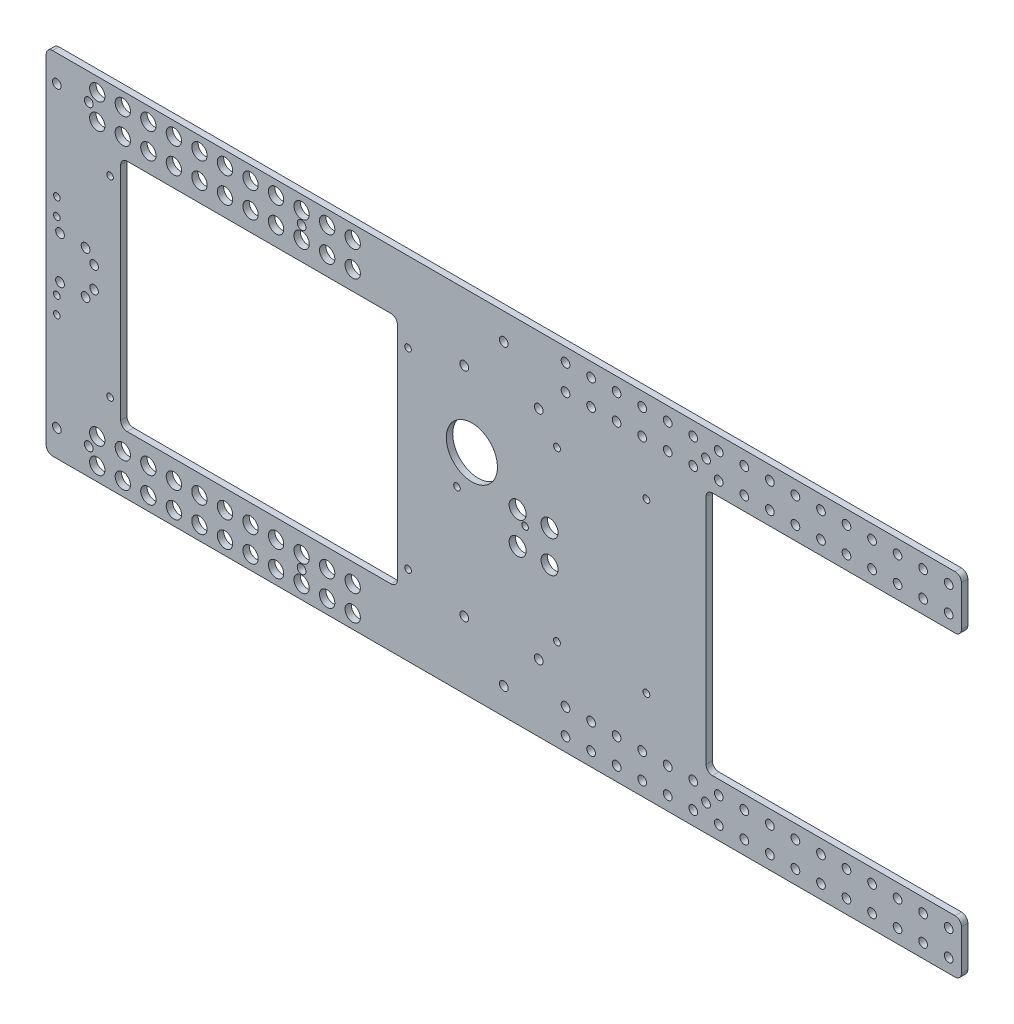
from build123d import *

# Parameters (mm, degrees)
SKETCH_1_W           = 430
SKETCH_1_H           = 165
SKETCH_1_R           = 2.05
EXTRUDE_1_DEPTH      = 3
SKETCH_2_R           = 4
SKETCH_2_R_2         = 12
CUT_EXTRUDE_1_DEPTH  = 25.001
SKETCH_3_R           = 2.05
SKETCH_3_R_2         = 1.55
SKETCH_3_W           = 130
SKETCH_3_H           = 110
CUT_EXTRUDE_2_DEPTH  = 10
SKETCH_4_R           = 2
CUT_EXTRUDE_3_DEPTH  = 5
SKETCH_5_W           = 240
SKETCH_5_H           = 115
CUT_EXTRUDE_4_DEPTH  = 10
SKETCH_7_R           = 2.05
CUT_EXTRUDE_5_DEPTH  = 66
SKETCH_8_R           = 1.6
CUT_EXTRUDE_6_DEPTH  = 10
SKETCH_9_R           = 1.55
CUT_EXTRUDE_7_DEPTH  = 10
SKETCH_10_R          = 1.55
CUT_EXTRUDE_8_DEPTH  = 10
SKETCH_11_R          = 2.05
CUT_EXTRUDE_9_DEPTH  = 3
SKETCH_12_R          = 3.6
CUT_EXTRUDE_10_DEPTH = 10
FILLET_1_R           = 3


with BuildPart() as part:
    # Sketch 1 → Extrude 1 (new body)
    with BuildSketch(Plane.XY):
        Rectangle(SKETCH_1_W, SKETCH_1_H)
        with Locations((-210, 70)):
            Circle(SKETCH_1_R, mode=Mode.SUBTRACT)
        with Locations((209, 76)):
            Circle(SKETCH_1_R, mode=Mode.SUBTRACT)
        with Locations(Location((209, 64, 0), (0, 0, 180))):
            Circle(SKETCH_1_R, mode=Mode.SUBTRACT)
        with Locations((-210, -70)):
            Circle(SKETCH_1_R, mode=Mode.SUBTRACT)
        with Locations((-195, 70)):
            Circle(SKETCH_1_R, mode=Mode.SUBTRACT)
        with Locations((209, -64)):
            Circle(SKETCH_1_R, mode=Mode.SUBTRACT)
        with Locations(Location((-195, -70, 0), (0, 0, 180))):
            Circle(SKETCH_1_R, mode=Mode.SUBTRACT)
        with Locations(Location((209, -76, 0), (0, 0, 180))):
            Circle(SKETCH_1_R, mode=Mode.SUBTRACT)
        with Locations((197, 76)):
            Circle(SKETCH_1_R, mode=Mode.SUBTRACT)
        with Locations(Location((197, 64, 0), (0, 0, 180))):
            Circle(SKETCH_1_R, mode=Mode.SUBTRACT)
        with Locations((197, -64)):
            Circle(SKETCH_1_R, mode=Mode.SUBTRACT)
        with Locations(Location((197, -76, 0), (0, 0, 180))):
            Circle(SKETCH_1_R, mode=Mode.SUBTRACT)
        with Locations((185, 76)):
            Circle(SKETCH_1_R, mode=Mode.SUBTRACT)
        with Locations(Location((185, 64, 0), (0, 0, 180))):
            Circle(SKETCH_1_R, mode=Mode.SUBTRACT)
        with Locations((185, -64)):
            Circle(SKETCH_1_R, mode=Mode.SUBTRACT)
        with Locations(Location((185, -76, 0), (0, 0, 180))):
            Circle(SKETCH_1_R, mode=Mode.SUBTRACT)
        with Locations((173, 76)):
            Circle(SKETCH_1_R, mode=Mode.SUBTRACT)
        with Locations(Location((173, 64, 0), (0, 0, 180))):
            Circle(SKETCH_1_R, mode=Mode.SUBTRACT)
        with Locations((173, -64)):
            Circle(SKETCH_1_R, mode=Mode.SUBTRACT)
        with Locations(Location((173, -76, 0), (0, 0, 180))):
            Circle(SKETCH_1_R, mode=Mode.SUBTRACT)
        with Locations((161, 76)):
            Circle(SKETCH_1_R, mode=Mode.SUBTRACT)
        with Locations(Location((161, 64, 0), (0, 0, 180))):
            Circle(SKETCH_1_R, mode=Mode.SUBTRACT)
        with Locations((161, -64)):
            Circle(SKETCH_1_R, mode=Mode.SUBTRACT)
        with Locations(Location((161, -76, 0), (0, 0, 180))):
            Circle(SKETCH_1_R, mode=Mode.SUBTRACT)
        with Locations((149, 76)):
            Circle(SKETCH_1_R, mode=Mode.SUBTRACT)
        with Locations(Location((149, 64, 0), (0, 0, 180))):
            Circle(SKETCH_1_R, mode=Mode.SUBTRACT)
        with Locations((149, -64)):
            Circle(SKETCH_1_R, mode=Mode.SUBTRACT)
        with Locations(Location((149, -76, 0), (0, 0, 180))):
            Circle(SKETCH_1_R, mode=Mode.SUBTRACT)
        with Locations((137, 76)):
            Circle(SKETCH_1_R, mode=Mode.SUBTRACT)
        with Locations(Location((137, 64, 0), (0, 0, 180))):
            Circle(SKETCH_1_R, mode=Mode.SUBTRACT)
        with Locations((137, -64)):
            Circle(SKETCH_1_R, mode=Mode.SUBTRACT)
        with Locations(Location((137, -76, 0), (0, 0, 180))):
            Circle(SKETCH_1_R, mode=Mode.SUBTRACT)
        with Locations((125, 76)):
            Circle(SKETCH_1_R, mode=Mode.SUBTRACT)
        with Locations(Location((125, 64, 0), (0, 0, 180))):
            Circle(SKETCH_1_R, mode=Mode.SUBTRACT)
        with Locations((125, -64)):
            Circle(SKETCH_1_R, mode=Mode.SUBTRACT)
        with Locations(Location((125, -76, 0), (0, 0, 180))):
            Circle(SKETCH_1_R, mode=Mode.SUBTRACT)
        with Locations((113, 76)):
            Circle(SKETCH_1_R, mode=Mode.SUBTRACT)
        with Locations(Location((113, 64, 0), (0, 0, 180))):
            Circle(SKETCH_1_R, mode=Mode.SUBTRACT)
        with Locations((113, -64)):
            Circle(SKETCH_1_R, mode=Mode.SUBTRACT)
        with Locations(Location((113, -76, 0), (0, 0, 180))):
            Circle(SKETCH_1_R, mode=Mode.SUBTRACT)
        with Locations((101, 76)):
            Circle(SKETCH_1_R, mode=Mode.SUBTRACT)
        with Locations(Location((101, 64, 0), (0, 0, 180))):
            Circle(SKETCH_1_R, mode=Mode.SUBTRACT)
        with Locations((101, -64)):
            Circle(SKETCH_1_R, mode=Mode.SUBTRACT)
        with Locations(Location((101, -76, 0), (0, 0, 180))):
            Circle(SKETCH_1_R, mode=Mode.SUBTRACT)
        with Locations((89, 76)):
            Circle(SKETCH_1_R, mode=Mode.SUBTRACT)
        with Locations(Location((89, 64, 0), (0, 0, 180))):
            Circle(SKETCH_1_R, mode=Mode.SUBTRACT)
        with Locations((89, -64)):
            Circle(SKETCH_1_R, mode=Mode.SUBTRACT)
        with Locations(Location((89, -76, 0), (0, 0, 180))):
            Circle(SKETCH_1_R, mode=Mode.SUBTRACT)
        with Locations((77, 76)):
            Circle(SKETCH_1_R, mode=Mode.SUBTRACT)
        with Locations(Location((77, 64, 0), (0, 0, 180))):
            Circle(SKETCH_1_R, mode=Mode.SUBTRACT)
        with Locations((77, -64)):
            Circle(SKETCH_1_R, mode=Mode.SUBTRACT)
        with Locations(Location((77, -76, 0), (0, 0, 180))):
            Circle(SKETCH_1_R, mode=Mode.SUBTRACT)
        with Locations((65, 76)):
            Circle(SKETCH_1_R, mode=Mode.SUBTRACT)
        with Locations(Location((65, 64, 0), (0, 0, 180))):
            Circle(SKETCH_1_R, mode=Mode.SUBTRACT)
        with Locations((65, -64)):
            Circle(SKETCH_1_R, mode=Mode.SUBTRACT)
        with Locations(Location((65, -76, 0), (0, 0, 180))):
            Circle(SKETCH_1_R, mode=Mode.SUBTRACT)
        with Locations((53, 76)):
            Circle(SKETCH_1_R, mode=Mode.SUBTRACT)
        with Locations(Location((53, 64, 0), (0, 0, 180))):
            Circle(SKETCH_1_R, mode=Mode.SUBTRACT)
        with Locations((53, -64)):
            Circle(SKETCH_1_R, mode=Mode.SUBTRACT)
        with Locations(Location((53, -76, 0), (0, 0, 180))):
            Circle(SKETCH_1_R, mode=Mode.SUBTRACT)
        with Locations((41, 76)):
            Circle(SKETCH_1_R, mode=Mode.SUBTRACT)
        with Locations(Location((41, 64, 0), (0, 0, 180))):
            Circle(SKETCH_1_R, mode=Mode.SUBTRACT)
        with Locations((41, -64)):
            Circle(SKETCH_1_R, mode=Mode.SUBTRACT)
        with Locations(Location((41, -76, 0), (0, 0, 180))):
            Circle(SKETCH_1_R, mode=Mode.SUBTRACT)
        with Locations((29, 76)):
            Circle(SKETCH_1_R, mode=Mode.SUBTRACT)
        with Locations(Location((29, 64, 0), (0, 0, 180))):
            Circle(SKETCH_1_R, mode=Mode.SUBTRACT)
        with Locations((29, -64)):
            Circle(SKETCH_1_R, mode=Mode.SUBTRACT)
        with Locations(Location((29, -76, 0), (0, 0, 180))):
            Circle(SKETCH_1_R, mode=Mode.SUBTRACT)
        with Locations((-71, 76)):
            Circle(SKETCH_1_R, mode=Mode.SUBTRACT)
        with Locations(Location((-71, 64, 0), (0, 0, 180))):
            Circle(SKETCH_1_R, mode=Mode.SUBTRACT)
        with Locations((-71, -64)):
            Circle(SKETCH_1_R, mode=Mode.SUBTRACT)
        with Locations(Location((-71, -76, 0), (0, 0, 180))):
            Circle(SKETCH_1_R, mode=Mode.SUBTRACT)
        with Locations((-83, 76)):
            Circle(SKETCH_1_R, mode=Mode.SUBTRACT)
        with Locations(Location((-83, 64, 0), (0, 0, 180))):
            Circle(SKETCH_1_R, mode=Mode.SUBTRACT)
        with Locations((-83, -64)):
            Circle(SKETCH_1_R, mode=Mode.SUBTRACT)
        with Locations(Location((-83, -76, 0), (0, 0, 180))):
            Circle(SKETCH_1_R, mode=Mode.SUBTRACT)
        with Locations((-95, 76)):
            Circle(SKETCH_1_R, mode=Mode.SUBTRACT)
        with Locations(Location((-95, 64, 0), (0, 0, 180))):
            Circle(SKETCH_1_R, mode=Mode.SUBTRACT)
        with Locations((-95, -64)):
            Circle(SKETCH_1_R, mode=Mode.SUBTRACT)
        with Locations(Location((-95, -76, 0), (0, 0, 180))):
            Circle(SKETCH_1_R, mode=Mode.SUBTRACT)
        with Locations((-107, 76)):
            Circle(SKETCH_1_R, mode=Mode.SUBTRACT)
        with Locations(Location((-107, 64, 0), (0, 0, 180))):
            Circle(SKETCH_1_R, mode=Mode.SUBTRACT)
        with Locations((-107, -64)):
            Circle(SKETCH_1_R, mode=Mode.SUBTRACT)
        with Locations(Location((-107, -76, 0), (0, 0, 180))):
            Circle(SKETCH_1_R, mode=Mode.SUBTRACT)
        with Locations((-119, 76)):
            Circle(SKETCH_1_R, mode=Mode.SUBTRACT)
        with Locations(Location((-119, 64, 0), (0, 0, 180))):
            Circle(SKETCH_1_R, mode=Mode.SUBTRACT)
        with Locations((-119, -64)):
            Circle(SKETCH_1_R, mode=Mode.SUBTRACT)
        with Locations(Location((-119, -76, 0), (0, 0, 180))):
            Circle(SKETCH_1_R, mode=Mode.SUBTRACT)
        with Locations((-131, 76)):
            Circle(SKETCH_1_R, mode=Mode.SUBTRACT)
        with Locations(Location((-131, 64, 0), (0, 0, 180))):
            Circle(SKETCH_1_R, mode=Mode.SUBTRACT)
        with Locations((-131, -64)):
            Circle(SKETCH_1_R, mode=Mode.SUBTRACT)
        with Locations(Location((-131, -76, 0), (0, 0, 180))):
            Circle(SKETCH_1_R, mode=Mode.SUBTRACT)
        with Locations((-143, 76)):
            Circle(SKETCH_1_R, mode=Mode.SUBTRACT)
        with Locations(Location((-143, 64, 0), (0, 0, 180))):
            Circle(SKETCH_1_R, mode=Mode.SUBTRACT)
        with Locations((-143, -64)):
            Circle(SKETCH_1_R, mode=Mode.SUBTRACT)
        with Locations(Location((-143, -76, 0), (0, 0, 180))):
            Circle(SKETCH_1_R, mode=Mode.SUBTRACT)
        with Locations((-155, 76)):
            Circle(SKETCH_1_R, mode=Mode.SUBTRACT)
        with Locations(Location((-155, 64, 0), (0, 0, 180))):
            Circle(SKETCH_1_R, mode=Mode.SUBTRACT)
        with Locations((-155, -64)):
            Circle(SKETCH_1_R, mode=Mode.SUBTRACT)
        with Locations(Location((-155, -76, 0), (0, 0, 180))):
            Circle(SKETCH_1_R, mode=Mode.SUBTRACT)
        with Locations((-167, 76)):
            Circle(SKETCH_1_R, mode=Mode.SUBTRACT)
        with Locations(Location((-167, 64, 0), (0, 0, 180))):
            Circle(SKETCH_1_R, mode=Mode.SUBTRACT)
        with Locations((-167, -64)):
            Circle(SKETCH_1_R, mode=Mode.SUBTRACT)
        with Locations(Location((-167, -76, 0), (0, 0, 180))):
            Circle(SKETCH_1_R, mode=Mode.SUBTRACT)
        with Locations((-179, 76)):
            Circle(SKETCH_1_R, mode=Mode.SUBTRACT)
        with Locations(Location((-179, 64, 0), (0, 0, 180))):
            Circle(SKETCH_1_R, mode=Mode.SUBTRACT)
        with Locations((-179, -64)):
            Circle(SKETCH_1_R, mode=Mode.SUBTRACT)
        with Locations(Location((-179, -76, 0), (0, 0, 180))):
            Circle(SKETCH_1_R, mode=Mode.SUBTRACT)
        with Locations((-191, 76)):
            Circle(SKETCH_1_R, mode=Mode.SUBTRACT)
        with Locations(Location((-191, 64, 0), (0, 0, 180))):
            Circle(SKETCH_1_R, mode=Mode.SUBTRACT)
        with Locations((-191, -64)):
            Circle(SKETCH_1_R, mode=Mode.SUBTRACT)
        with Locations(Location((-191, -76, 0), (0, 0, 180))):
            Circle(SKETCH_1_R, mode=Mode.SUBTRACT)
    extrude(amount=EXTRUDE_1_DEPTH)

    # Sketch 2 → Cut-Extrude 1 (cut)
    with BuildSketch(Plane.XY.offset(3)):
        with Locations((6.5, 5)):
            Circle(SKETCH_2_R)
        with Locations((-15, 17.5)):
            Circle(SKETCH_2_R_2)
        with Locations((21.5, 5)):
            Circle(SKETCH_2_R)
        with Locations((21.5, -10)):
            Circle(SKETCH_2_R)
        with Locations((6.5, -10)):
            Circle(SKETCH_2_R)
    extrude(amount=-CUT_EXTRUDE_1_DEPTH, mode=Mode.SUBTRACT)

    # Sketch 3 → Cut-Extrude 2 (cut)
    with BuildSketch(Plane.XY.offset(3)):
        with Locations((-208.5, 10)):
            Circle(SKETCH_3_R)
        with Locations((-196.5, 10)):
            Circle(SKETCH_3_R)
        with Locations((-196.5, -10)):
            Circle(SKETCH_3_R)
        with Locations((-208.5, -10)):
            Circle(SKETCH_3_R)
        with Locations((-22, 0)):
            Circle(SKETCH_3_R_2)
        with Locations((10, 0)):
            Circle(SKETCH_3_R_2)
        with Locations((-115, 0)):
            Rectangle(SKETCH_3_W, SKETCH_3_H)
    extrude(amount=-CUT_EXTRUDE_2_DEPTH, mode=Mode.SUBTRACT)

    # Sketch 4 → Cut-Extrude 3 (cut)
    with BuildSketch(Plane.XY.offset(3)):
        with Locations((-192.5, 5)):
            Circle(SKETCH_4_R)
        with Locations(Location((-192.5, -5, 0), (0, 0, 180))):
            Circle(SKETCH_4_R)
    extrude(amount=-CUT_EXTRUDE_3_DEPTH, mode=Mode.SUBTRACT)

    # Sketch 5 → Cut-Extrude 4 (cut)
    with BuildSketch(Plane.XY.offset(3)):
        with Locations((215, 0)):
            Rectangle(SKETCH_5_W, SKETCH_5_H)
    extrude(amount=-CUT_EXTRUDE_4_DEPTH, mode=Mode.SUBTRACT)

    # Sketch 7 → Cut-Extrude 5 (cut)
    with BuildSketch(Plane.XY.offset(3)):
        with Locations((-95, -70)):
            Circle(SKETCH_7_R)
        with Locations((0, -70)):
            Circle(SKETCH_7_R)
        with Locations((95, -70)):
            Circle(SKETCH_7_R)
        with Locations(Location((95, 70, 0), (0, 0, 180))):
            Circle(SKETCH_7_R)
        with Locations(Location((0, 70, 0), (0, 0, 180))):
            Circle(SKETCH_7_R)
        with Locations(Location((-95, 70, 0), (0, 0, 180))):
            Circle(SKETCH_7_R)
    extrude(amount=-CUT_EXTRUDE_5_DEPTH, mode=Mode.SUBTRACT)

    # Sketch 8 → Cut-Extrude 6 (cut)
    with BuildSketch(Plane.XY.offset(3)):
        with Locations((25, 39.5)):
            Circle(SKETCH_8_R)
        with Locations((67, 39.5)):
            Circle(SKETCH_8_R)
        with Locations((67, -39.5)):
            Circle(SKETCH_8_R)
        with Locations((25, -39.5)):
            Circle(SKETCH_8_R)
    extrude(amount=-CUT_EXTRUDE_6_DEPTH, mode=Mode.SUBTRACT)

    # Sketch 9 → Cut-Extrude 7 (cut)
    with BuildSketch(Plane.XY.offset(3)):
        with Locations((-45, 45)):
            Circle(SKETCH_9_R)
        with Locations((-185, -45)):
            Circle(SKETCH_9_R)
        with Locations(Location((-45, -45, 0), (0, 0, 180))):
            Circle(SKETCH_9_R)
        with Locations(Location((-185, 45, 0), (0, 0, 180))):
            Circle(SKETCH_9_R)
    extrude(amount=-CUT_EXTRUDE_7_DEPTH, mode=Mode.SUBTRACT)

    # Sketch 10 → Cut-Extrude 8 (cut)
    with BuildSketch(Plane(origin=(0, 0, 0), x_dir=(-1, 0, 0), z_dir=(0, 0, -1))):
        with Locations((210, 16)):
            Circle(SKETCH_10_R)
        with Locations((210, 24)):
            Circle(SKETCH_10_R)
        with Locations((210, -16)):
            Circle(SKETCH_10_R)
        with Locations((210, -24)):
            Circle(SKETCH_10_R)
    extrude(amount=-CUT_EXTRUDE_8_DEPTH, mode=Mode.SUBTRACT)

    # Sketch 11 → Cut-Extrude 9 (cut)
    with BuildSketch(Plane.XY.offset(3)):
        with Locations((-18.593678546, 51)):
            Circle(SKETCH_11_R)
        with Locations((16.406321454, 51)):
            Circle(SKETCH_11_R)
        with Locations((16.406321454, -51)):
            Circle(SKETCH_11_R)
        with Locations((-18.593678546, -51)):
            Circle(SKETCH_11_R)
    extrude(amount=-CUT_EXTRUDE_9_DEPTH, mode=Mode.SUBTRACT)

    # Sketch 12 → Cut-Extrude 10 (cut)
    with BuildSketch(Plane.XY.offset(3)):
        with Locations((-191, 76)):
            Circle(SKETCH_12_R)
        with Locations((-191, 64)):
            Circle(SKETCH_12_R)
        with Locations((-191, -64)):
            Circle(SKETCH_12_R)
        with Locations((-191, -76)):
            Circle(SKETCH_12_R)
        with Locations((-179, 76)):
            Circle(SKETCH_12_R)
        with Locations((-179, 64)):
            Circle(SKETCH_12_R)
        with Locations((-179, -64)):
            Circle(SKETCH_12_R)
        with Locations((-179, -76)):
            Circle(SKETCH_12_R)
        with Locations((-167, 76)):
            Circle(SKETCH_12_R)
        with Locations((-167, 64)):
            Circle(SKETCH_12_R)
        with Locations((-167, -64)):
            Circle(SKETCH_12_R)
        with Locations((-167, -76)):
            Circle(SKETCH_12_R)
        with Locations((-155, 76)):
            Circle(SKETCH_12_R)
        with Locations((-155, 64)):
            Circle(SKETCH_12_R)
        with Locations((-155, -64)):
            Circle(SKETCH_12_R)
        with Locations((-155, -76)):
            Circle(SKETCH_12_R)
        with Locations((-143, 76)):
            Circle(SKETCH_12_R)
        with Locations((-143, 64)):
            Circle(SKETCH_12_R)
        with Locations((-143, -64)):
            Circle(SKETCH_12_R)
        with Locations((-143, -76)):
            Circle(SKETCH_12_R)
        with Locations((-131, 76)):
            Circle(SKETCH_12_R)
        with Locations((-131, 64)):
            Circle(SKETCH_12_R)
        with Locations((-131, -64)):
            Circle(SKETCH_12_R)
        with Locations((-131, -76)):
            Circle(SKETCH_12_R)
        with Locations((-119, 76)):
            Circle(SKETCH_12_R)
        with Locations((-119, 64)):
            Circle(SKETCH_12_R)
        with Locations((-119, -64)):
            Circle(SKETCH_12_R)
        with Locations((-119, -76)):
            Circle(SKETCH_12_R)
        with Locations((-107, 76)):
            Circle(SKETCH_12_R)
        with Locations((-107, 64)):
            Circle(SKETCH_12_R)
        with Locations((-107, -64)):
            Circle(SKETCH_12_R)
        with Locations((-107, -76)):
            Circle(SKETCH_12_R)
        with Locations((-95, 76)):
            Circle(SKETCH_12_R)
        with Locations((-95, 64)):
            Circle(SKETCH_12_R)
        with Locations((-95, -64)):
            Circle(SKETCH_12_R)
        with Locations((-95, -76)):
            Circle(SKETCH_12_R)
        with Locations((-83, 76)):
            Circle(SKETCH_12_R)
        with Locations((-83, 64)):
            Circle(SKETCH_12_R)
        with Locations((-83, -64)):
            Circle(SKETCH_12_R)
        with Locations((-83, -76)):
            Circle(SKETCH_12_R)
        with Locations((-71, 76)):
            Circle(SKETCH_12_R)
        with Locations((-71, 64)):
            Circle(SKETCH_12_R)
        with Locations((-71, -64)):
            Circle(SKETCH_12_R)
        with Locations((-71, -76)):
            Circle(SKETCH_12_R)
    extrude(amount=-CUT_EXTRUDE_10_DEPTH, mode=Mode.SUBTRACT)

    # Fillet 1
    fillet_1_edges = [part.edges().sort_by_distance(p)[0] for p in [
        (-50, 55, 1.5),
        (-50, -55, 1.5),
        (-180, -55, 1.5),
        (-180, 55, 1.5),
        (215, 57.5, 1.5),
        (215, -57.5, 1.5),
        (95, -57.5, 1.5),
        (95, 57.5, 1.5),
        (215, -82.5, 1.5),
        (-215, -82.5, 1.5),
        (-215, 82.5, 1.5),
        (215, 82.5, 1.5),
    ]]
    fillet(fillet_1_edges, radius=FILLET_1_R)


solid = part.part
